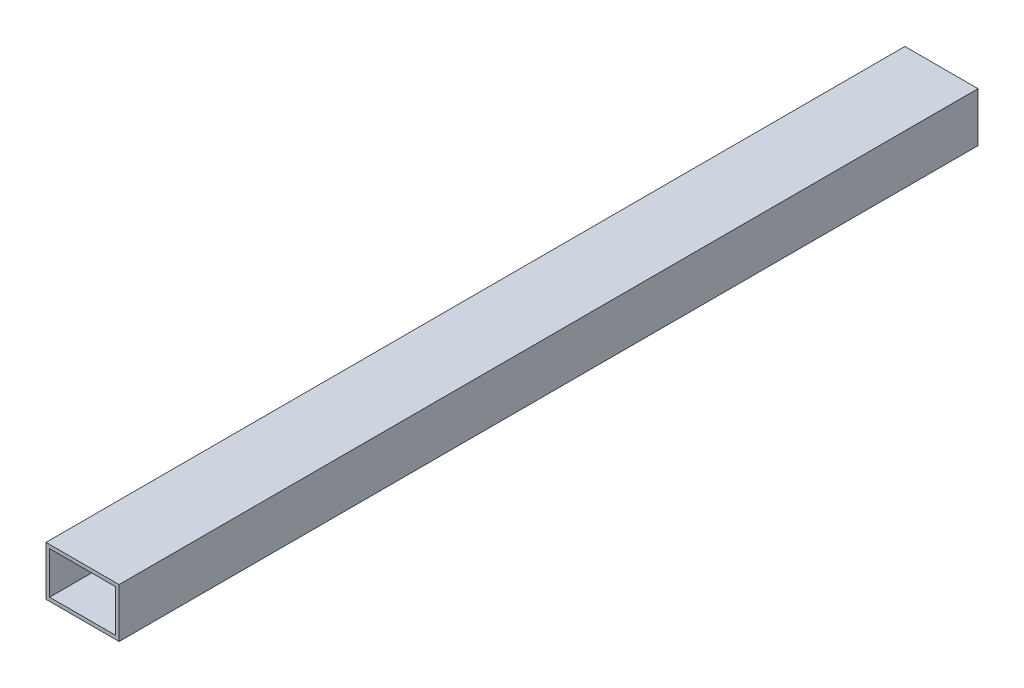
ISO-10303-21;
HEADER;
FILE_DESCRIPTION(('STEP AP214'),'2;1');
FILE_NAME('part.step','',(''),(''),'','','');
FILE_SCHEMA(('AUTOMOTIVE_DESIGN { 1 0 10303 214 1 1 1 1 }'));
ENDSEC;
DATA;
#1=APPLICATION_CONTEXT('core data for automotive mechanical design processes');
#2=APPLICATION_PROTOCOL_DEFINITION('international standard','automotive_design',2000,#1);
#3=PRODUCT_CONTEXT('',#1,'mechanical');
#4=PRODUCT('Part','Part','',(#3));
#5=PRODUCT_RELATED_PRODUCT_CATEGORY('part','',(#4));
#6=PRODUCT_DEFINITION_FORMATION('','',#4);
#7=PRODUCT_DEFINITION_CONTEXT('part definition',#1,'design');
#8=PRODUCT_DEFINITION('design','',#6,#7);
#9=PRODUCT_DEFINITION_SHAPE('','',#8);
#10=(LENGTH_UNIT() NAMED_UNIT(*) SI_UNIT(.MILLI.,.METRE.));
#11=(NAMED_UNIT(*) PLANE_ANGLE_UNIT() SI_UNIT($,.RADIAN.));
#12=(NAMED_UNIT(*) SI_UNIT($,.STERADIAN.) SOLID_ANGLE_UNIT());
#13=UNCERTAINTY_MEASURE_WITH_UNIT(LENGTH_MEASURE(1.E-05),#10,'distance_accuracy_value','');
#14=(GEOMETRIC_REPRESENTATION_CONTEXT(3) GLOBAL_UNCERTAINTY_ASSIGNED_CONTEXT((#13)) GLOBAL_UNIT_ASSIGNED_CONTEXT((#10,
#11,#12)) REPRESENTATION_CONTEXT('',''));
#15=CARTESIAN_POINT('',(0.,0.,0.));
#16=DIRECTION('',(0.,0.,1.));
#17=DIRECTION('',(1.,0.,0.));
#18=AXIS2_PLACEMENT_3D('',#15,#16,#17);
#19=CARTESIAN_POINT('',(38.,-2.,470.));
#20=DIRECTION('',(0.,0.,1.));
#21=DIRECTION('',(1.,0.,0.));
#22=AXIS2_PLACEMENT_3D('',#19,#20,#21);
#23=PLANE('',#22);
#24=DIRECTION('',(1.,0.,0.));
#25=VECTOR('',#24,1.);
#26=CARTESIAN_POINT('',(-2.,-2.,470.));
#27=LINE('',#26,#25);
#28=CARTESIAN_POINT('',(-2.,-2.,470.));
#29=VERTEX_POINT('',#28);
#30=CARTESIAN_POINT('',(38.,-2.,470.));
#31=VERTEX_POINT('',#30);
#32=EDGE_CURVE('E143',#29,#31,#27,.T.);
#33=ORIENTED_EDGE('',*,*,#32,.T.);
#34=DIRECTION('',(0.,1.,0.));
#35=VECTOR('',#34,1.);
#36=CARTESIAN_POINT('',(38.,-2.,470.));
#37=LINE('',#36,#35);
#38=CARTESIAN_POINT('',(38.,25.,470.));
#39=VERTEX_POINT('',#38);
#40=EDGE_CURVE('E146',#31,#39,#37,.T.);
#41=ORIENTED_EDGE('',*,*,#40,.T.);
#42=DIRECTION('',(-1.,0.,0.));
#43=VECTOR('',#42,1.);
#44=CARTESIAN_POINT('',(-2.,25.,470.));
#45=LINE('',#44,#43);
#46=CARTESIAN_POINT('',(-2.,25.,470.));
#47=VERTEX_POINT('',#46);
#48=EDGE_CURVE('E148',#39,#47,#45,.T.);
#49=ORIENTED_EDGE('',*,*,#48,.T.);
#50=DIRECTION('',(0.,-1.,0.));
#51=VECTOR('',#50,1.);
#52=CARTESIAN_POINT('',(-2.,-2.,470.));
#53=LINE('',#52,#51);
#54=EDGE_CURVE('E150',#47,#29,#53,.T.);
#55=ORIENTED_EDGE('',*,*,#54,.T.);
#56=EDGE_LOOP('',(#33,#41,#49,#55));
#57=FACE_BOUND('',#56,.T.);
#58=DIRECTION('',(1.,0.,0.));
#59=VECTOR('',#58,1.);
#60=CARTESIAN_POINT('',(0.,0.,470.));
#61=LINE('',#60,#59);
#62=CARTESIAN_POINT('',(0.,0.,470.));
#63=VERTEX_POINT('',#62);
#64=CARTESIAN_POINT('',(36.,0.,470.));
#65=VERTEX_POINT('',#64);
#66=EDGE_CURVE('E125',#63,#65,#61,.T.);
#67=ORIENTED_EDGE('',*,*,#66,.F.);
#68=DIRECTION('',(0.,-1.,0.));
#69=VECTOR('',#68,1.);
#70=CARTESIAN_POINT('',(0.,0.,470.));
#71=LINE('',#70,#69);
#72=CARTESIAN_POINT('',(0.,23.,470.));
#73=VERTEX_POINT('',#72);
#74=EDGE_CURVE('E114',#73,#63,#71,.T.);
#75=ORIENTED_EDGE('',*,*,#74,.F.);
#76=DIRECTION('',(-1.,0.,0.));
#77=VECTOR('',#76,1.);
#78=CARTESIAN_POINT('',(0.,23.,470.));
#79=LINE('',#78,#77);
#80=CARTESIAN_POINT('',(36.,23.,470.));
#81=VERTEX_POINT('',#80);
#82=EDGE_CURVE('E129',#81,#73,#79,.T.);
#83=ORIENTED_EDGE('',*,*,#82,.F.);
#84=DIRECTION('',(0.,1.,0.));
#85=VECTOR('',#84,1.);
#86=CARTESIAN_POINT('',(36.,0.,470.));
#87=LINE('',#86,#85);
#88=EDGE_CURVE('E127',#65,#81,#87,.T.);
#89=ORIENTED_EDGE('',*,*,#88,.F.);
#90=EDGE_LOOP('',(#67,#75,#83,#89));
#91=FACE_BOUND('',#90,.T.);
#92=ADVANCED_FACE('F34',(#57,#91),#23,.T.);
#93=CARTESIAN_POINT('',(38.,-2.,0.));
#94=DIRECTION('',(0.,0.,1.));
#95=DIRECTION('',(1.,0.,0.));
#96=AXIS2_PLACEMENT_3D('',#93,#94,#95);
#97=PLANE('',#96);
#98=DIRECTION('',(1.,0.,0.));
#99=VECTOR('',#98,1.);
#100=CARTESIAN_POINT('',(-2.,-2.,0.));
#101=LINE('',#100,#99);
#102=CARTESIAN_POINT('',(-2.,-2.,0.));
#103=VERTEX_POINT('',#102);
#104=CARTESIAN_POINT('',(38.,-2.,0.));
#105=VERTEX_POINT('',#104);
#106=EDGE_CURVE('E115',#103,#105,#101,.T.);
#107=ORIENTED_EDGE('',*,*,#106,.F.);
#108=DIRECTION('',(0.,-1.,0.));
#109=VECTOR('',#108,1.);
#110=CARTESIAN_POINT('',(-2.,-2.,0.));
#111=LINE('',#110,#109);
#112=CARTESIAN_POINT('',(-2.,25.,0.));
#113=VERTEX_POINT('',#112);
#114=EDGE_CURVE('E141',#113,#103,#111,.T.);
#115=ORIENTED_EDGE('',*,*,#114,.F.);
#116=DIRECTION('',(-1.,0.,0.));
#117=VECTOR('',#116,1.);
#118=CARTESIAN_POINT('',(-2.,25.,0.));
#119=LINE('',#118,#117);
#120=CARTESIAN_POINT('',(38.,25.,0.));
#121=VERTEX_POINT('',#120);
#122=EDGE_CURVE('E139',#121,#113,#119,.T.);
#123=ORIENTED_EDGE('',*,*,#122,.F.);
#124=DIRECTION('',(0.,1.,0.));
#125=VECTOR('',#124,1.);
#126=CARTESIAN_POINT('',(38.,-2.,0.));
#127=LINE('',#126,#125);
#128=EDGE_CURVE('E137',#105,#121,#127,.T.);
#129=ORIENTED_EDGE('',*,*,#128,.F.);
#130=EDGE_LOOP('',(#107,#115,#123,#129));
#131=FACE_BOUND('',#130,.T.);
#132=DIRECTION('',(0.,-1.,0.));
#133=VECTOR('',#132,1.);
#134=CARTESIAN_POINT('',(0.,0.,0.));
#135=LINE('',#134,#133);
#136=CARTESIAN_POINT('',(0.,23.,0.));
#137=VERTEX_POINT('',#136);
#138=CARTESIAN_POINT('',(0.,0.,0.));
#139=VERTEX_POINT('',#138);
#140=EDGE_CURVE('E57',#137,#139,#135,.T.);
#141=ORIENTED_EDGE('',*,*,#140,.T.);
#142=DIRECTION('',(1.,0.,0.));
#143=VECTOR('',#142,1.);
#144=CARTESIAN_POINT('',(0.,0.,0.));
#145=LINE('',#144,#143);
#146=CARTESIAN_POINT('',(36.,0.,0.));
#147=VERTEX_POINT('',#146);
#148=EDGE_CURVE('E101',#139,#147,#145,.T.);
#149=ORIENTED_EDGE('',*,*,#148,.T.);
#150=DIRECTION('',(0.,1.,0.));
#151=VECTOR('',#150,1.);
#152=CARTESIAN_POINT('',(36.,0.,0.));
#153=LINE('',#152,#151);
#154=CARTESIAN_POINT('',(36.,23.,0.));
#155=VERTEX_POINT('',#154);
#156=EDGE_CURVE('E110',#147,#155,#153,.T.);
#157=ORIENTED_EDGE('',*,*,#156,.T.);
#158=DIRECTION('',(-1.,0.,0.));
#159=VECTOR('',#158,1.);
#160=CARTESIAN_POINT('',(0.,23.,0.));
#161=LINE('',#160,#159);
#162=EDGE_CURVE('E119',#155,#137,#161,.T.);
#163=ORIENTED_EDGE('',*,*,#162,.T.);
#164=EDGE_LOOP('',(#141,#149,#157,#163));
#165=FACE_BOUND('',#164,.T.);
#166=ADVANCED_FACE('F118',(#131,#165),#97,.F.);
#167=CARTESIAN_POINT('',(-2.,-2.,470.));
#168=DIRECTION('',(0.,1.,0.));
#169=DIRECTION('',(0.,0.,1.));
#170=AXIS2_PLACEMENT_3D('',#167,#168,#169);
#171=PLANE('',#170);
#172=ORIENTED_EDGE('',*,*,#106,.T.);
#173=DIRECTION('',(0.,0.,-1.));
#174=VECTOR('',#173,1.);
#175=CARTESIAN_POINT('',(38.,-2.,470.));
#176=LINE('',#175,#174);
#177=EDGE_CURVE('E11',#31,#105,#176,.T.);
#178=ORIENTED_EDGE('',*,*,#177,.F.);
#179=ORIENTED_EDGE('',*,*,#32,.F.);
#180=DIRECTION('',(0.,0.,-1.));
#181=VECTOR('',#180,1.);
#182=CARTESIAN_POINT('',(-2.,-2.,470.));
#183=LINE('',#182,#181);
#184=EDGE_CURVE('E152',#29,#103,#183,.T.);
#185=ORIENTED_EDGE('',*,*,#184,.T.);
#186=EDGE_LOOP('',(#172,#178,#179,#185));
#187=FACE_BOUND('',#186,.T.);
#188=ADVANCED_FACE('F36',(#187),#171,.F.);
#189=CARTESIAN_POINT('',(38.,-2.,470.));
#190=DIRECTION('',(-1.,0.,0.));
#191=DIRECTION('',(0.,0.,1.));
#192=AXIS2_PLACEMENT_3D('',#189,#190,#191);
#193=PLANE('',#192);
#194=ORIENTED_EDGE('',*,*,#128,.T.);
#195=DIRECTION('',(0.,0.,-1.));
#196=VECTOR('',#195,1.);
#197=CARTESIAN_POINT('',(38.,25.,470.));
#198=LINE('',#197,#196);
#199=EDGE_CURVE('E42',#39,#121,#198,.T.);
#200=ORIENTED_EDGE('',*,*,#199,.F.);
#201=ORIENTED_EDGE('',*,*,#40,.F.);
#202=ORIENTED_EDGE('',*,*,#177,.T.);
#203=EDGE_LOOP('',(#194,#200,#201,#202));
#204=FACE_BOUND('',#203,.T.);
#205=ADVANCED_FACE('F177',(#204),#193,.F.);
#206=CARTESIAN_POINT('',(-2.,25.,470.));
#207=DIRECTION('',(0.,-1.,0.));
#208=DIRECTION('',(0.,0.,-1.));
#209=AXIS2_PLACEMENT_3D('',#206,#207,#208);
#210=PLANE('',#209);
#211=ORIENTED_EDGE('',*,*,#122,.T.);
#212=DIRECTION('',(0.,0.,-1.));
#213=VECTOR('',#212,1.);
#214=CARTESIAN_POINT('',(-2.,25.,470.));
#215=LINE('',#214,#213);
#216=EDGE_CURVE('E155',#47,#113,#215,.T.);
#217=ORIENTED_EDGE('',*,*,#216,.F.);
#218=ORIENTED_EDGE('',*,*,#48,.F.);
#219=ORIENTED_EDGE('',*,*,#199,.T.);
#220=EDGE_LOOP('',(#211,#217,#218,#219));
#221=FACE_BOUND('',#220,.T.);
#222=ADVANCED_FACE('F162',(#221),#210,.F.);
#223=CARTESIAN_POINT('',(-2.,-2.,470.));
#224=DIRECTION('',(1.,0.,0.));
#225=DIRECTION('',(0.,0.,-1.));
#226=AXIS2_PLACEMENT_3D('',#223,#224,#225);
#227=PLANE('',#226);
#228=ORIENTED_EDGE('',*,*,#114,.T.);
#229=ORIENTED_EDGE('',*,*,#184,.F.);
#230=ORIENTED_EDGE('',*,*,#54,.F.);
#231=ORIENTED_EDGE('',*,*,#216,.T.);
#232=EDGE_LOOP('',(#228,#229,#230,#231));
#233=FACE_BOUND('',#232,.T.);
#234=ADVANCED_FACE('F170',(#233),#227,.F.);
#235=CARTESIAN_POINT('',(0.,0.,470.));
#236=DIRECTION('',(1.,0.,0.));
#237=DIRECTION('',(0.,0.,-1.));
#238=AXIS2_PLACEMENT_3D('',#235,#236,#237);
#239=PLANE('',#238);
#240=ORIENTED_EDGE('',*,*,#140,.F.);
#241=DIRECTION('',(0.,0.,-1.));
#242=VECTOR('',#241,1.);
#243=CARTESIAN_POINT('',(0.,23.,470.));
#244=LINE('',#243,#242);
#245=EDGE_CURVE('E131',#73,#137,#244,.T.);
#246=ORIENTED_EDGE('',*,*,#245,.F.);
#247=ORIENTED_EDGE('',*,*,#74,.T.);
#248=DIRECTION('',(0.,0.,-1.));
#249=VECTOR('',#248,1.);
#250=CARTESIAN_POINT('',(0.,0.,470.));
#251=LINE('',#250,#249);
#252=EDGE_CURVE('E103',#63,#139,#251,.T.);
#253=ORIENTED_EDGE('',*,*,#252,.T.);
#254=EDGE_LOOP('',(#240,#246,#247,#253));
#255=FACE_BOUND('',#254,.T.);
#256=ADVANCED_FACE('F112',(#255),#239,.T.);
#257=CARTESIAN_POINT('',(0.,0.,470.));
#258=DIRECTION('',(0.,1.,0.));
#259=DIRECTION('',(0.,0.,1.));
#260=AXIS2_PLACEMENT_3D('',#257,#258,#259);
#261=PLANE('',#260);
#262=ORIENTED_EDGE('',*,*,#148,.F.);
#263=ORIENTED_EDGE('',*,*,#252,.F.);
#264=ORIENTED_EDGE('',*,*,#66,.T.);
#265=DIRECTION('',(0.,0.,-1.));
#266=VECTOR('',#265,1.);
#267=CARTESIAN_POINT('',(36.,0.,470.));
#268=LINE('',#267,#266);
#269=EDGE_CURVE('E106',#65,#147,#268,.T.);
#270=ORIENTED_EDGE('',*,*,#269,.T.);
#271=EDGE_LOOP('',(#262,#263,#264,#270));
#272=FACE_BOUND('',#271,.T.);
#273=ADVANCED_FACE('F102',(#272),#261,.T.);
#274=CARTESIAN_POINT('',(36.,0.,470.));
#275=DIRECTION('',(-1.,0.,0.));
#276=DIRECTION('',(0.,0.,1.));
#277=AXIS2_PLACEMENT_3D('',#274,#275,#276);
#278=PLANE('',#277);
#279=ORIENTED_EDGE('',*,*,#156,.F.);
#280=ORIENTED_EDGE('',*,*,#269,.F.);
#281=ORIENTED_EDGE('',*,*,#88,.T.);
#282=DIRECTION('',(0.,0.,-1.));
#283=VECTOR('',#282,1.);
#284=CARTESIAN_POINT('',(36.,23.,470.));
#285=LINE('',#284,#283);
#286=EDGE_CURVE('E49',#81,#155,#285,.T.);
#287=ORIENTED_EDGE('',*,*,#286,.T.);
#288=EDGE_LOOP('',(#279,#280,#281,#287));
#289=FACE_BOUND('',#288,.T.);
#290=ADVANCED_FACE('F199',(#289),#278,.T.);
#291=CARTESIAN_POINT('',(0.,23.,470.));
#292=DIRECTION('',(0.,-1.,0.));
#293=DIRECTION('',(0.,0.,-1.));
#294=AXIS2_PLACEMENT_3D('',#291,#292,#293);
#295=PLANE('',#294);
#296=ORIENTED_EDGE('',*,*,#162,.F.);
#297=ORIENTED_EDGE('',*,*,#286,.F.);
#298=ORIENTED_EDGE('',*,*,#82,.T.);
#299=ORIENTED_EDGE('',*,*,#245,.T.);
#300=EDGE_LOOP('',(#296,#297,#298,#299));
#301=FACE_BOUND('',#300,.T.);
#302=ADVANCED_FACE('F204',(#301),#295,.T.);
#303=CLOSED_SHELL('',(#92,#166,#188,#205,#222,#234,#256,#273,#290,#302));
#304=MANIFOLD_SOLID_BREP('B2',#303);
#305=ADVANCED_BREP_SHAPE_REPRESENTATION('',(#18,#304),#14);
#306=SHAPE_DEFINITION_REPRESENTATION(#9,#305);
ENDSEC;
END-ISO-10303-21;
